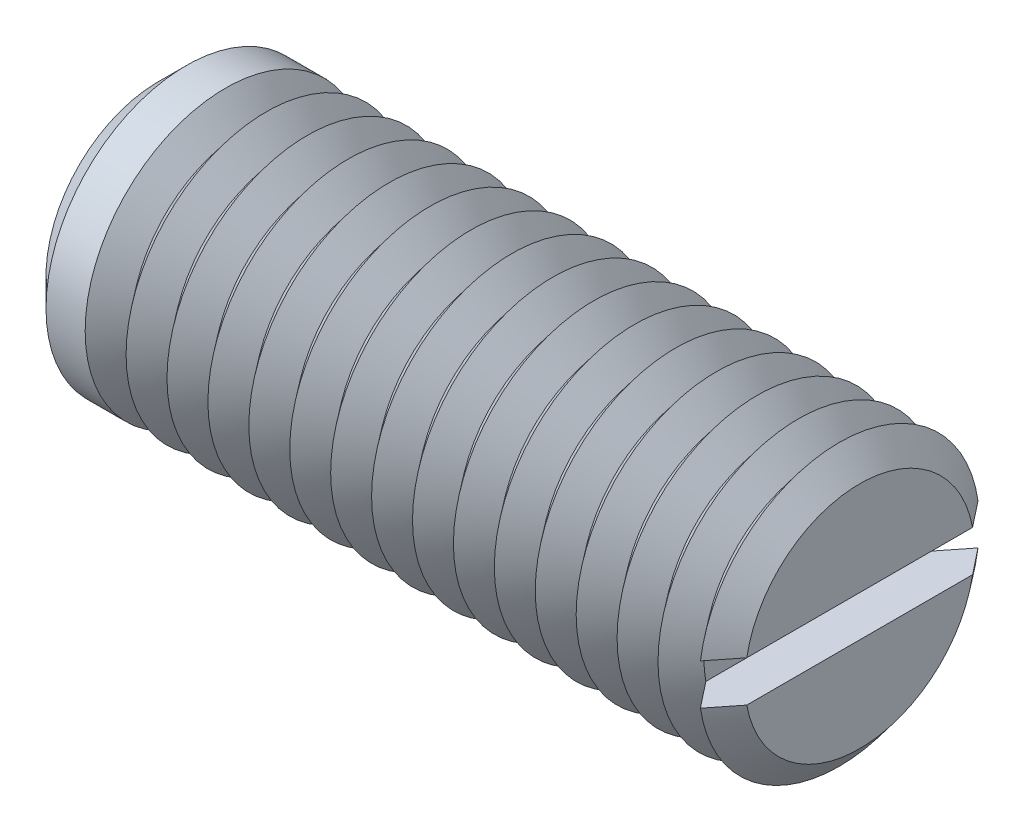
from build123d import *

# Parameters (mm, degrees)
SKETCH1_R       = 6
EXTRUDE1_DEPTH  = 15
SKETCH2_W       = 1.75
SKETCH2_H       = 1.75
EXTRUDE2_DEPTH  = 9
CHAMFER1_SIZE   = 1.2
LPATTERN1_COUNT = 16
LPATTERN1_PITCH = 1.75


with BuildPart() as part:
    # Sketch1 → Extrude1 (new, symmetric)
    with BuildSketch(Plane(origin=(0, 0, 0), x_dir=(0, 0, -1), z_dir=(1, 0, 0))):
        Circle(SKETCH1_R)
    extrude(amount=EXTRUDE1_DEPTH, both=True)

    # Sketch2 → Extrude2 (cut, symmetric)
    with BuildSketch(Plane.XY):
        with Locations((14.125, 0)):
            Rectangle(SKETCH2_W, SKETCH2_H)
    extrude(amount=EXTRUDE2_DEPTH, both=True, mode=Mode.SUBTRACT)

    # Chamfer1
    chamfer1_edges = [part.edges().sort_by_distance(p)[0] for p in [
        (-15, 0, 6),
    ]]
    chamfer(chamfer1_edges, length=CHAMFER1_SIZE)

    # Sketch3 → Cut-Revolve1 (revolve, cut)
    with BuildSketch(Plane.XY, mode=Mode.PRIVATE) as cut_revolve1_sk:
        Polygon((14.125, -6), (15.875, -6), (15, -4.90712535), align=None)
    cut_revolve1 = revolve(cut_revolve1_sk.sketch.rotate(Axis((0, 0, 0), (1, 0, 0)), 261.614461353), axis=Axis((0, 0, 0), (1, 0, 0)), mode=Mode.SUBTRACT)

    # LPattern1: Cut-Revolve1 ×16
    with Locations(*[(-i * LPATTERN1_PITCH, 0, 0) for i in range(1, LPATTERN1_COUNT)]):
        add(cut_revolve1, mode=Mode.SUBTRACT)


solid = part.part
